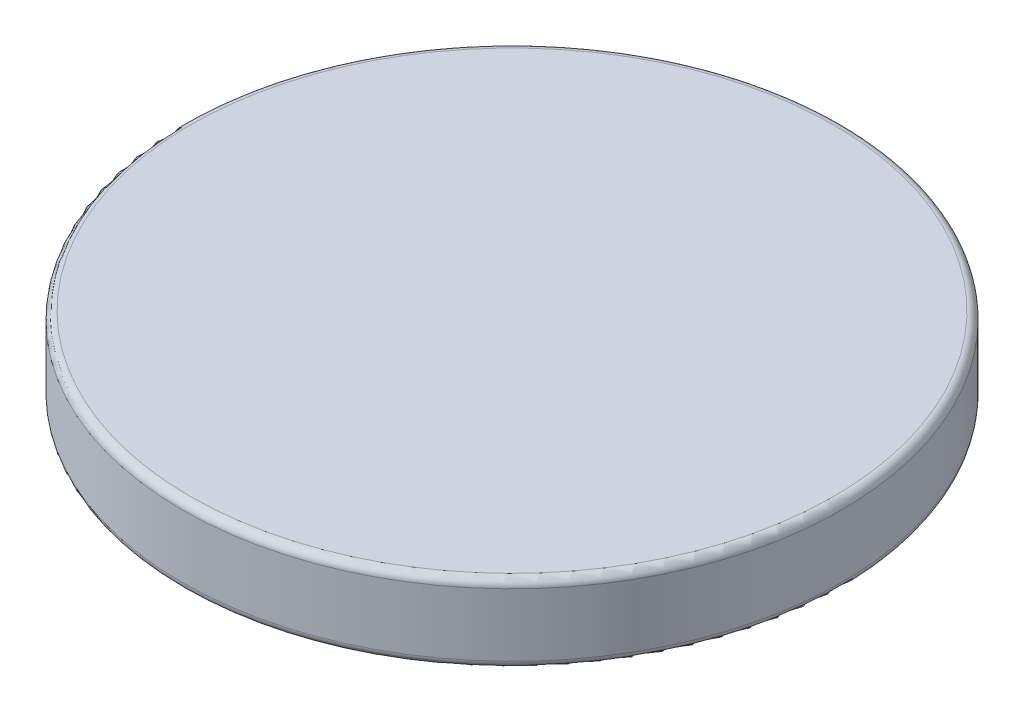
ISO-10303-21;
HEADER;
FILE_DESCRIPTION(('STEP AP214'),'2;1');
FILE_NAME('part.step','',(''),(''),'','','');
FILE_SCHEMA(('AUTOMOTIVE_DESIGN { 1 0 10303 214 1 1 1 1 }'));
ENDSEC;
DATA;
#1=APPLICATION_CONTEXT('core data for automotive mechanical design processes');
#2=APPLICATION_PROTOCOL_DEFINITION('international standard','automotive_design',2000,#1);
#3=PRODUCT_CONTEXT('',#1,'mechanical');
#4=PRODUCT('Part','Part','',(#3));
#5=PRODUCT_RELATED_PRODUCT_CATEGORY('part','',(#4));
#6=PRODUCT_DEFINITION_FORMATION('','',#4);
#7=PRODUCT_DEFINITION_CONTEXT('part definition',#1,'design');
#8=PRODUCT_DEFINITION('design','',#6,#7);
#9=PRODUCT_DEFINITION_SHAPE('','',#8);
#10=(LENGTH_UNIT() NAMED_UNIT(*) SI_UNIT(.MILLI.,.METRE.));
#11=(NAMED_UNIT(*) PLANE_ANGLE_UNIT() SI_UNIT($,.RADIAN.));
#12=(NAMED_UNIT(*) SI_UNIT($,.STERADIAN.) SOLID_ANGLE_UNIT());
#13=UNCERTAINTY_MEASURE_WITH_UNIT(LENGTH_MEASURE(1.E-05),#10,'distance_accuracy_value','');
#14=(GEOMETRIC_REPRESENTATION_CONTEXT(3) GLOBAL_UNCERTAINTY_ASSIGNED_CONTEXT((#13)) GLOBAL_UNIT_ASSIGNED_CONTEXT((#10,
#11,#12)) REPRESENTATION_CONTEXT('',''));
#15=CARTESIAN_POINT('',(0.,0.,0.));
#16=DIRECTION('',(0.,0.,1.));
#17=DIRECTION('',(1.,0.,0.));
#18=AXIS2_PLACEMENT_3D('',#15,#16,#17);
#19=CARTESIAN_POINT('',(0.,5.,0.));
#20=DIRECTION('',(0.,-1.,0.));
#21=DIRECTION('',(0.,0.,-1.));
#22=AXIS2_PLACEMENT_3D('',#19,#20,#21);
#23=CYLINDRICAL_SURFACE('',#22,21.);
#24=CARTESIAN_POINT('',(0.,0.5,0.));
#25=DIRECTION('',(0.,1.,0.));
#26=DIRECTION('',(0.,0.,1.));
#27=AXIS2_PLACEMENT_3D('',#24,#25,#26);
#28=CIRCLE('',#27,21.);
#29=CARTESIAN_POINT('',(0.,0.5,21.));
#30=VERTEX_POINT('',#29);
#31=EDGE_CURVE('E40',#30,#30,#28,.T.);
#32=ORIENTED_EDGE('',*,*,#31,.T.);
#33=EDGE_LOOP('',(#32));
#34=FACE_BOUND('',#33,.T.);
#35=CARTESIAN_POINT('',(0.,4.5,0.));
#36=DIRECTION('',(0.,1.,0.));
#37=DIRECTION('',(0.,0.,1.));
#38=AXIS2_PLACEMENT_3D('',#35,#36,#37);
#39=CIRCLE('',#38,21.);
#40=CARTESIAN_POINT('',(0.,4.5,21.));
#41=VERTEX_POINT('',#40);
#42=EDGE_CURVE('E44',#41,#41,#39,.F.);
#43=ORIENTED_EDGE('',*,*,#42,.T.);
#44=EDGE_LOOP('',(#43));
#45=FACE_BOUND('',#44,.T.);
#46=ADVANCED_FACE('F29',(#34,#45),#23,.T.);
#47=CARTESIAN_POINT('',(0.,5.,0.));
#48=DIRECTION('',(0.,1.,0.));
#49=DIRECTION('',(0.,0.,1.));
#50=AXIS2_PLACEMENT_3D('',#47,#48,#49);
#51=PLANE('',#50);
#52=CARTESIAN_POINT('',(0.,5.,0.));
#53=DIRECTION('',(0.,1.,0.));
#54=DIRECTION('',(0.,0.,1.));
#55=AXIS2_PLACEMENT_3D('',#52,#53,#54);
#56=CIRCLE('',#55,20.5);
#57=CARTESIAN_POINT('',(0.,5.,20.5));
#58=VERTEX_POINT('',#57);
#59=EDGE_CURVE('E10',#58,#58,#56,.T.);
#60=ORIENTED_EDGE('',*,*,#59,.T.);
#61=EDGE_LOOP('',(#60));
#62=FACE_BOUND('',#61,.T.);
#63=ADVANCED_FACE('F60',(#62),#51,.T.);
#64=CARTESIAN_POINT('',(0.,0.,0.));
#65=DIRECTION('',(0.,1.,0.));
#66=DIRECTION('',(0.,0.,1.));
#67=AXIS2_PLACEMENT_3D('',#64,#65,#66);
#68=PLANE('',#67);
#69=CARTESIAN_POINT('',(0.,0.,0.));
#70=DIRECTION('',(0.,1.,0.));
#71=DIRECTION('',(0.,0.,1.));
#72=AXIS2_PLACEMENT_3D('',#69,#70,#71);
#73=CIRCLE('',#72,20.5);
#74=CARTESIAN_POINT('',(0.,0.,20.5));
#75=VERTEX_POINT('',#74);
#76=EDGE_CURVE('E36',#75,#75,#73,.F.);
#77=ORIENTED_EDGE('',*,*,#76,.T.);
#78=EDGE_LOOP('',(#77));
#79=FACE_BOUND('',#78,.T.);
#80=ADVANCED_FACE('F57',(#79),#68,.F.);
#81=CARTESIAN_POINT('',(0.,0.5,0.));
#82=DIRECTION('',(0.,1.,0.));
#83=DIRECTION('',(0.,0.,1.));
#84=AXIS2_PLACEMENT_3D('',#81,#82,#83);
#85=TOROIDAL_SURFACE('',#84,20.5,0.5);
#86=ORIENTED_EDGE('',*,*,#76,.F.);
#87=EDGE_LOOP('',(#86));
#88=FACE_BOUND('',#87,.T.);
#89=ORIENTED_EDGE('',*,*,#31,.F.);
#90=EDGE_LOOP('',(#89));
#91=FACE_BOUND('',#90,.T.);
#92=ADVANCED_FACE('F53',(#88,#91),#85,.T.);
#93=CARTESIAN_POINT('',(0.,4.5,0.));
#94=DIRECTION('',(0.,1.,0.));
#95=DIRECTION('',(0.,0.,1.));
#96=AXIS2_PLACEMENT_3D('',#93,#94,#95);
#97=TOROIDAL_SURFACE('',#96,20.5,0.5);
#98=ORIENTED_EDGE('',*,*,#42,.F.);
#99=EDGE_LOOP('',(#98));
#100=FACE_BOUND('',#99,.T.);
#101=ORIENTED_EDGE('',*,*,#59,.F.);
#102=EDGE_LOOP('',(#101));
#103=FACE_BOUND('',#102,.T.);
#104=ADVANCED_FACE('F31',(#100,#103),#97,.T.);
#105=CLOSED_SHELL('',(#46,#63,#80,#92,#104));
#106=MANIFOLD_SOLID_BREP('B2',#105);
#107=ADVANCED_BREP_SHAPE_REPRESENTATION('',(#18,#106),#14);
#108=SHAPE_DEFINITION_REPRESENTATION(#9,#107);
ENDSEC;
END-ISO-10303-21;
